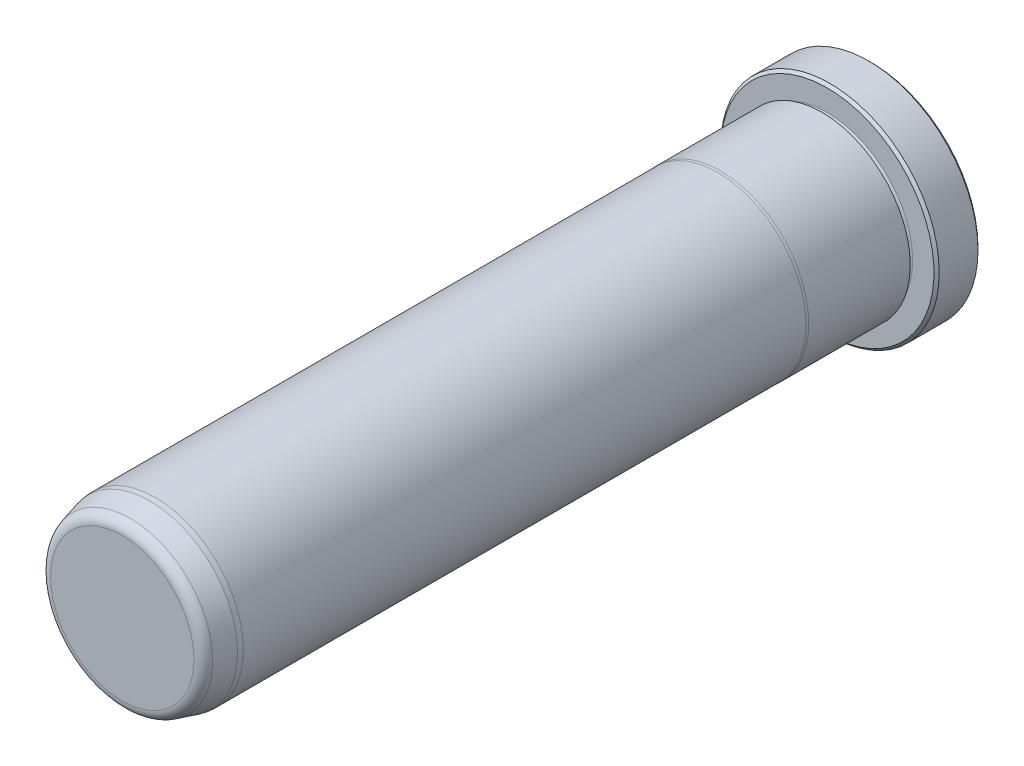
ISO-10303-21;
HEADER;
FILE_DESCRIPTION(('STEP AP214'),'2;1');
FILE_NAME('part.step','',(''),(''),'','','');
FILE_SCHEMA(('AUTOMOTIVE_DESIGN { 1 0 10303 214 1 1 1 1 }'));
ENDSEC;
DATA;
#1=APPLICATION_CONTEXT('core data for automotive mechanical design processes');
#2=APPLICATION_PROTOCOL_DEFINITION('international standard','automotive_design',2000,#1);
#3=PRODUCT_CONTEXT('',#1,'mechanical');
#4=PRODUCT('Part','Part','',(#3));
#5=PRODUCT_RELATED_PRODUCT_CATEGORY('part','',(#4));
#6=PRODUCT_DEFINITION_FORMATION('','',#4);
#7=PRODUCT_DEFINITION_CONTEXT('part definition',#1,'design');
#8=PRODUCT_DEFINITION('design','',#6,#7);
#9=PRODUCT_DEFINITION_SHAPE('','',#8);
#10=(LENGTH_UNIT() NAMED_UNIT(*) SI_UNIT(.MILLI.,.METRE.));
#11=(NAMED_UNIT(*) PLANE_ANGLE_UNIT() SI_UNIT($,.RADIAN.));
#12=(NAMED_UNIT(*) SI_UNIT($,.STERADIAN.) SOLID_ANGLE_UNIT());
#13=UNCERTAINTY_MEASURE_WITH_UNIT(LENGTH_MEASURE(1.E-05),#10,'distance_accuracy_value','');
#14=(GEOMETRIC_REPRESENTATION_CONTEXT(3) GLOBAL_UNCERTAINTY_ASSIGNED_CONTEXT((#13)) GLOBAL_UNIT_ASSIGNED_CONTEXT((#10,
#11,#12)) REPRESENTATION_CONTEXT('',''));
#15=CARTESIAN_POINT('',(0.,0.,0.));
#16=DIRECTION('',(0.,0.,1.));
#17=DIRECTION('',(1.,0.,0.));
#18=AXIS2_PLACEMENT_3D('',#15,#16,#17);
#19=CARTESIAN_POINT('',(0.,0.,0.));
#20=DIRECTION('',(0.,0.,1.));
#21=DIRECTION('',(1.,0.,0.));
#22=AXIS2_PLACEMENT_3D('',#19,#20,#21);
#23=PLANE('',#22);
#24=CARTESIAN_POINT('',(0.,0.,0.));
#25=DIRECTION('',(0.,0.,1.));
#26=DIRECTION('',(1.,0.,0.));
#27=AXIS2_PLACEMENT_3D('',#24,#25,#26);
#28=CIRCLE('',#27,15.367);
#29=CARTESIAN_POINT('',(15.367,0.,0.));
#30=VERTEX_POINT('',#29);
#31=EDGE_CURVE('E37',#30,#30,#28,.F.);
#32=ORIENTED_EDGE('',*,*,#31,.T.);
#33=EDGE_LOOP('',(#32));
#34=FACE_BOUND('',#33,.T.);
#35=ADVANCED_FACE('F30',(#34),#23,.F.);
#36=CARTESIAN_POINT('',(0.,0.,0.));
#37=DIRECTION('',(0.,0.,1.));
#38=DIRECTION('',(1.,0.,0.));
#39=AXIS2_PLACEMENT_3D('',#36,#37,#38);
#40=CYLINDRICAL_SURFACE('',#39,15.748);
#41=CARTESIAN_POINT('',(0.,0.,0.38100000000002));
#42=DIRECTION('',(0.,0.,1.));
#43=DIRECTION('',(1.,0.,0.));
#44=AXIS2_PLACEMENT_3D('',#41,#42,#43);
#45=CIRCLE('',#44,15.748);
#46=CARTESIAN_POINT('',(15.748,0.,0.38100000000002));
#47=VERTEX_POINT('',#46);
#48=EDGE_CURVE('E41',#47,#47,#45,.T.);
#49=ORIENTED_EDGE('',*,*,#48,.T.);
#50=EDGE_LOOP('',(#49));
#51=FACE_BOUND('',#50,.T.);
#52=CARTESIAN_POINT('',(0.,0.,5.96900000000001));
#53=DIRECTION('',(0.,0.,-1.));
#54=DIRECTION('',(-1.,0.,0.));
#55=AXIS2_PLACEMENT_3D('',#52,#53,#54);
#56=CIRCLE('',#55,15.748);
#57=CARTESIAN_POINT('',(-15.748,0.,5.96900000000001));
#58=VERTEX_POINT('',#57);
#59=EDGE_CURVE('E45',#58,#58,#56,.T.);
#60=ORIENTED_EDGE('',*,*,#59,.T.);
#61=EDGE_LOOP('',(#60));
#62=FACE_BOUND('',#61,.T.);
#63=ADVANCED_FACE('F118',(#51,#62),#40,.T.);
#64=CARTESIAN_POINT('',(0.,15.748,6.35));
#65=DIRECTION('',(0.,0.,-1.));
#66=DIRECTION('',(-1.,0.,0.));
#67=AXIS2_PLACEMENT_3D('',#64,#65,#66);
#68=PLANE('',#67);
#69=CARTESIAN_POINT('',(0.,0.,6.35));
#70=DIRECTION('',(0.,0.,-1.));
#71=DIRECTION('',(-1.,0.,0.));
#72=AXIS2_PLACEMENT_3D('',#69,#70,#71);
#73=CIRCLE('',#72,15.367);
#74=CARTESIAN_POINT('',(-15.367,0.,6.35));
#75=VERTEX_POINT('',#74);
#76=EDGE_CURVE('E10',#75,#75,#73,.F.);
#77=ORIENTED_EDGE('',*,*,#76,.T.);
#78=EDGE_LOOP('',(#77));
#79=FACE_BOUND('',#78,.T.);
#80=CARTESIAN_POINT('',(0.,0.,6.35));
#81=DIRECTION('',(0.,0.,1.));
#82=DIRECTION('',(1.,0.,0.));
#83=AXIS2_PLACEMENT_3D('',#80,#81,#82);
#84=CIRCLE('',#83,12.3063);
#85=CARTESIAN_POINT('',(12.3063,0.,6.35));
#86=VERTEX_POINT('',#85);
#87=EDGE_CURVE('E56',#86,#86,#84,.T.);
#88=ORIENTED_EDGE('',*,*,#87,.F.);
#89=EDGE_LOOP('',(#88));
#90=FACE_BOUND('',#89,.T.);
#91=ADVANCED_FACE('F113',(#79,#90),#68,.F.);
#92=CARTESIAN_POINT('',(0.,0.,6.731));
#93=DIRECTION('',(0.,0.,1.));
#94=DIRECTION('',(1.,0.,0.));
#95=AXIS2_PLACEMENT_3D('',#92,#93,#94);
#96=TOROIDAL_SURFACE('',#95,12.3063,0.381);
#97=CARTESIAN_POINT('',(0.,0.,7.112));
#98=DIRECTION('',(0.,0.,1.));
#99=DIRECTION('',(1.,0.,0.));
#100=AXIS2_PLACEMENT_3D('',#97,#98,#99);
#101=CIRCLE('',#100,12.3063);
#102=CARTESIAN_POINT('',(12.3063,0.,7.112));
#103=VERTEX_POINT('',#102);
#104=EDGE_CURVE('E59',#103,#103,#101,.T.);
#105=ORIENTED_EDGE('',*,*,#104,.F.);
#106=EDGE_LOOP('',(#105));
#107=FACE_BOUND('',#106,.T.);
#108=ORIENTED_EDGE('',*,*,#87,.T.);
#109=EDGE_LOOP('',(#108));
#110=FACE_BOUND('',#109,.T.);
#111=ADVANCED_FACE('F107',(#107,#110),#96,.F.);
#112=CARTESIAN_POINT('',(0.,12.3063,7.112));
#113=DIRECTION('',(0.,0.,1.));
#114=DIRECTION('',(1.,0.,0.));
#115=AXIS2_PLACEMENT_3D('',#112,#113,#114);
#116=PLANE('',#115);
#117=CARTESIAN_POINT('',(0.,0.,7.112));
#118=DIRECTION('',(0.,0.,1.));
#119=DIRECTION('',(1.,0.,0.));
#120=AXIS2_PLACEMENT_3D('',#117,#118,#119);
#121=CIRCLE('',#120,12.7127);
#122=CARTESIAN_POINT('',(12.7127,0.,7.112));
#123=VERTEX_POINT('',#122);
#124=EDGE_CURVE('E62',#123,#123,#121,.T.);
#125=ORIENTED_EDGE('',*,*,#124,.F.);
#126=EDGE_LOOP('',(#125));
#127=FACE_BOUND('',#126,.T.);
#128=ORIENTED_EDGE('',*,*,#104,.T.);
#129=EDGE_LOOP('',(#128));
#130=FACE_BOUND('',#129,.T.);
#131=ADVANCED_FACE('F101',(#127,#130),#116,.F.);
#132=CARTESIAN_POINT('',(0.,0.,0.));
#133=DIRECTION('',(0.,0.,1.));
#134=DIRECTION('',(1.,0.,0.));
#135=AXIS2_PLACEMENT_3D('',#132,#133,#134);
#136=CYLINDRICAL_SURFACE('',#135,12.7127);
#137=CARTESIAN_POINT('',(0.,0.,21.7347630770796));
#138=DIRECTION('',(0.,0.,1.));
#139=DIRECTION('',(1.,0.,0.));
#140=AXIS2_PLACEMENT_3D('',#137,#138,#139);
#141=CIRCLE('',#140,12.7127);
#142=CARTESIAN_POINT('',(12.7127,0.,21.7347630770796));
#143=VERTEX_POINT('',#142);
#144=EDGE_CURVE('E65',#143,#143,#141,.T.);
#145=ORIENTED_EDGE('',*,*,#144,.F.);
#146=EDGE_LOOP('',(#145));
#147=FACE_BOUND('',#146,.T.);
#148=ORIENTED_EDGE('',*,*,#124,.T.);
#149=EDGE_LOOP('',(#148));
#150=FACE_BOUND('',#149,.T.);
#151=ADVANCED_FACE('F95',(#147,#150),#136,.T.);
#152=CARTESIAN_POINT('',(0.,0.,21.7347630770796));
#153=DIRECTION('',(0.,0.,-1.));
#154=DIRECTION('',(-1.,0.,0.));
#155=AXIS2_PLACEMENT_3D('',#152,#153,#154);
#156=CONICAL_SURFACE('',#155,12.7127,0.069813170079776);
#157=CARTESIAN_POINT('',(0.,0.,22.098));
#158=DIRECTION('',(0.,0.,1.));
#159=DIRECTION('',(1.,0.,0.));
#160=AXIS2_PLACEMENT_3D('',#157,#158,#159);
#161=CIRCLE('',#160,12.6873);
#162=CARTESIAN_POINT('',(12.6873,0.,22.098));
#163=VERTEX_POINT('',#162);
#164=EDGE_CURVE('E68',#163,#163,#161,.T.);
#165=ORIENTED_EDGE('',*,*,#164,.F.);
#166=EDGE_LOOP('',(#165));
#167=FACE_BOUND('',#166,.T.);
#168=ORIENTED_EDGE('',*,*,#144,.T.);
#169=EDGE_LOOP('',(#168));
#170=FACE_BOUND('',#169,.T.);
#171=ADVANCED_FACE('F89',(#167,#170),#156,.T.);
#172=CARTESIAN_POINT('',(0.,0.,0.));
#173=DIRECTION('',(0.,0.,1.));
#174=DIRECTION('',(1.,0.,0.));
#175=AXIS2_PLACEMENT_3D('',#172,#173,#174);
#176=CYLINDRICAL_SURFACE('',#175,12.6873);
#177=CARTESIAN_POINT('',(0.,0.,103.1875));
#178=DIRECTION('',(0.,0.,1.));
#179=DIRECTION('',(1.,0.,0.));
#180=AXIS2_PLACEMENT_3D('',#177,#178,#179);
#181=CIRCLE('',#180,12.6873);
#182=CARTESIAN_POINT('',(12.6873,0.,103.1875));
#183=VERTEX_POINT('',#182);
#184=EDGE_CURVE('E71',#183,#183,#181,.T.);
#185=ORIENTED_EDGE('',*,*,#184,.F.);
#186=EDGE_LOOP('',(#185));
#187=FACE_BOUND('',#186,.T.);
#188=ORIENTED_EDGE('',*,*,#164,.T.);
#189=EDGE_LOOP('',(#188));
#190=FACE_BOUND('',#189,.T.);
#191=ADVANCED_FACE('F83',(#187,#190),#176,.T.);
#192=CARTESIAN_POINT('',(0.,0.,103.1875));
#193=DIRECTION('',(0.,0.,-1.));
#194=DIRECTION('',(-1.,0.,0.));
#195=AXIS2_PLACEMENT_3D('',#192,#193,#194);
#196=CONICAL_SURFACE('',#195,12.6873,0.0872664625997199);
#197=CARTESIAN_POINT('',(0.,0.,103.9495));
#198=DIRECTION('',(0.,0.,1.));
#199=DIRECTION('',(1.,0.,0.));
#200=AXIS2_PLACEMENT_3D('',#197,#198,#199);
#201=CIRCLE('',#200,12.6206336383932);
#202=CARTESIAN_POINT('',(12.6206336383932,0.,103.9495));
#203=VERTEX_POINT('',#202);
#204=EDGE_CURVE('E74',#203,#203,#201,.T.);
#205=ORIENTED_EDGE('',*,*,#204,.F.);
#206=EDGE_LOOP('',(#205));
#207=FACE_BOUND('',#206,.T.);
#208=ORIENTED_EDGE('',*,*,#184,.T.);
#209=EDGE_LOOP('',(#208));
#210=FACE_BOUND('',#209,.T.);
#211=ADVANCED_FACE('F80',(#207,#210),#196,.T.);
#212=CARTESIAN_POINT('',(0.,0.,103.9495));
#213=DIRECTION('',(0.,0.,-1.));
#214=DIRECTION('',(-1.,0.,0.));
#215=AXIS2_PLACEMENT_3D('',#212,#213,#214);
#216=CONICAL_SURFACE('',#215,12.6206336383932,0.261799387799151);
#217=CARTESIAN_POINT('',(0.,0.,106.7733752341));
#218=DIRECTION('',(0.,0.,1.));
#219=DIRECTION('',(1.,0.,0.));
#220=AXIS2_PLACEMENT_3D('',#217,#218,#219);
#221=CIRCLE('',#220,11.8639785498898);
#222=CARTESIAN_POINT('',(11.8639785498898,0.,106.7733752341));
#223=VERTEX_POINT('',#222);
#224=EDGE_CURVE('E50',#223,#223,#221,.F.);
#225=ORIENTED_EDGE('',*,*,#224,.T.);
#226=EDGE_LOOP('',(#225));
#227=FACE_BOUND('',#226,.T.);
#228=ORIENTED_EDGE('',*,*,#204,.T.);
#229=EDGE_LOOP('',(#228));
#230=FACE_BOUND('',#229,.T.);
#231=ADVANCED_FACE('F78',(#227,#230),#216,.T.);
#232=CARTESIAN_POINT('',(0.,11.5487028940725,107.95));
#233=DIRECTION('',(0.,0.,-1.));
#234=DIRECTION('',(-1.,0.,0.));
#235=AXIS2_PLACEMENT_3D('',#232,#233,#234);
#236=PLANE('',#235);
#237=CARTESIAN_POINT('',(0.,0.,107.95));
#238=DIRECTION('',(0.,0.,-1.));
#239=DIRECTION('',(-1.,0.,0.));
#240=AXIS2_PLACEMENT_3D('',#237,#238,#239);
#241=CIRCLE('',#240,10.3305713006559);
#242=CARTESIAN_POINT('',(-10.3305713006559,0.,107.95));
#243=VERTEX_POINT('',#242);
#244=EDGE_CURVE('E53',#243,#243,#241,.F.);
#245=ORIENTED_EDGE('',*,*,#244,.T.);
#246=EDGE_LOOP('',(#245));
#247=FACE_BOUND('',#246,.T.);
#248=ADVANCED_FACE('F133',(#247),#236,.F.);
#249=CARTESIAN_POINT('',(0.,0.,106.3625));
#250=DIRECTION('',(0.,0.,-1.));
#251=DIRECTION('',(-1.,0.,0.));
#252=AXIS2_PLACEMENT_3D('',#249,#250,#251);
#253=TOROIDAL_SURFACE('',#252,10.3305713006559,1.5875);
#254=ORIENTED_EDGE('',*,*,#224,.F.);
#255=EDGE_LOOP('',(#254));
#256=FACE_BOUND('',#255,.T.);
#257=ORIENTED_EDGE('',*,*,#244,.F.);
#258=EDGE_LOOP('',(#257));
#259=FACE_BOUND('',#258,.T.);
#260=ADVANCED_FACE('F130',(#256,#259),#253,.T.);
#261=CARTESIAN_POINT('',(0.,0.,0.38100000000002));
#262=DIRECTION('',(0.,0.,1.));
#263=DIRECTION('',(1.,0.,0.));
#264=AXIS2_PLACEMENT_3D('',#261,#262,#263);
#265=CONICAL_SURFACE('',#264,15.748,0.78539816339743);
#266=ORIENTED_EDGE('',*,*,#31,.F.);
#267=EDGE_LOOP('',(#266));
#268=FACE_BOUND('',#267,.T.);
#269=ORIENTED_EDGE('',*,*,#48,.F.);
#270=EDGE_LOOP('',(#269));
#271=FACE_BOUND('',#270,.T.);
#272=ADVANCED_FACE('F132',(#268,#271),#265,.T.);
#273=CARTESIAN_POINT('',(0.,0.,6.35));
#274=DIRECTION('',(0.,0.,-1.));
#275=DIRECTION('',(-1.,0.,0.));
#276=AXIS2_PLACEMENT_3D('',#273,#274,#275);
#277=CONICAL_SURFACE('',#276,15.367,0.78539816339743);
#278=ORIENTED_EDGE('',*,*,#59,.F.);
#279=EDGE_LOOP('',(#278));
#280=FACE_BOUND('',#279,.T.);
#281=ORIENTED_EDGE('',*,*,#76,.F.);
#282=EDGE_LOOP('',(#281));
#283=FACE_BOUND('',#282,.T.);
#284=ADVANCED_FACE('F32',(#280,#283),#277,.T.);
#285=CLOSED_SHELL('',(#35,#63,#91,#111,#131,#151,#171,#191,#211,#231,#248,#260,#272,#284));
#286=MANIFOLD_SOLID_BREP('B2',#285);
#287=ADVANCED_BREP_SHAPE_REPRESENTATION('',(#18,#286),#14);
#288=SHAPE_DEFINITION_REPRESENTATION(#9,#287);
ENDSEC;
END-ISO-10303-21;
